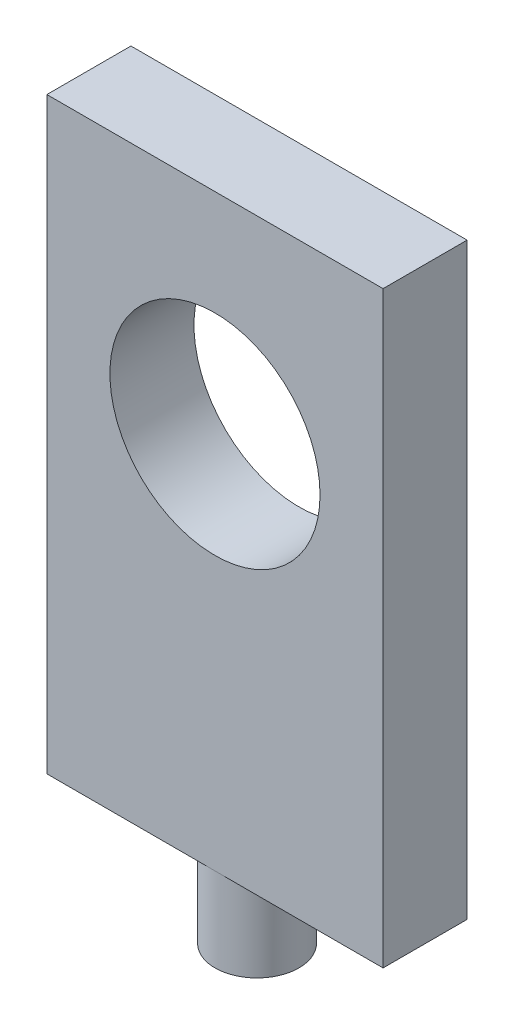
from build123d import *

# Parameters (mm, degrees)
ESQUISSE1_W             = 40
ESQUISSE1_H             = 70
BOSS_EXTRU_1_DEPTH      = 10
ESQUISSE2_R             = 12.5
ENL_V_MAT_EXTRU_1_DEPTH = 82.240384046
ESQUISSE3_R             = 5
BOSS_EXTRU_2_DEPTH      = 10


with BuildPart() as part:
    # Esquisse1 → Boss.-Extru.1 (new body)
    with BuildSketch(Plane.XY):
        with Locations((20, 35)):
            Rectangle(ESQUISSE1_W, ESQUISSE1_H)
    extrude(amount=BOSS_EXTRU_1_DEPTH)

    # Esquisse2 → Enl_v. mat.-Extru.1 (cut, through all)
    with BuildSketch(Plane.XY.offset(10)):
        with Locations((20, 45)):
            Circle(ESQUISSE2_R)
    extrude(amount=-ENL_V_MAT_EXTRU_1_DEPTH, mode=Mode.SUBTRACT)

    # Esquisse3 → Boss.-Extru.2 (add)
    with BuildSketch(Plane.XZ):
        with Locations(Location((20, 5, 0), (0, 0, 270))):
            Circle(ESQUISSE3_R)
    extrude(amount=BOSS_EXTRU_2_DEPTH)


solid = part.part
